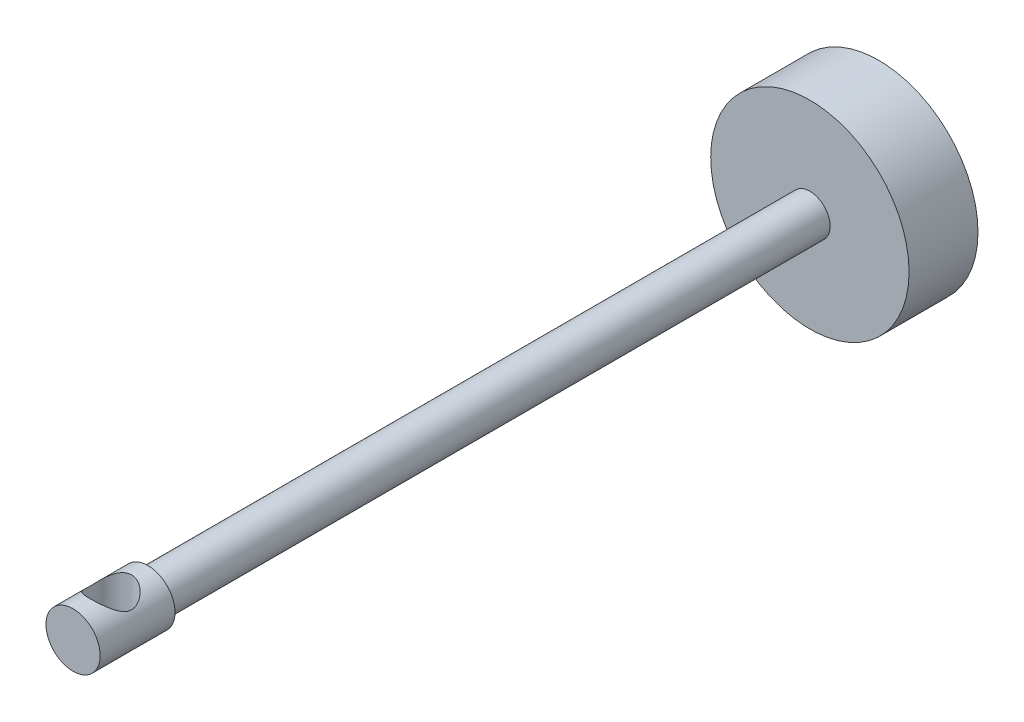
from build123d import *

# Parameters (mm, degrees)
SKETCH1_R               = 11.51636
EXTRUDE1_DEPTH          = 8.001
SKETCH2_R               = 2.3495
EXTRUDE2_DEPTH          = 93.5482
SKETCH3_R               = 3.1496
EXTRUDE3_DEPTH          = 8.6868
CUT_EXTRUDE1_DEPTH      = 95.955351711
CUT_EXTRUDE1_DEPTH_BACK = 95.955351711
SKETCH4_R               = 2.4003


with BuildPart() as part:
    # Sketch1 → Extrude1 (new body)
    with BuildSketch(Plane.XY):
        with Locations(Location((0, 0, 0), (0, 0, 180))):
            Circle(SKETCH1_R)
    extrude(amount=EXTRUDE1_DEPTH)

    # Sketch2 → Extrude2 (add)
    with BuildSketch(Plane.XY):
        with Locations(Location((0, 0, 0), (0, 0, 180))):
            Circle(SKETCH2_R)
    extrude(amount=EXTRUDE2_DEPTH)

    # Sketch3 → Extrude3 (add)
    with BuildSketch(Plane.XY.offset(93.5482)):
        Circle(SKETCH3_R)
    extrude(amount=-EXTRUDE3_DEPTH)

    # Sketch4 → Cut-Extrude1 (cut, two sides: drawn at the far end of the back side and taken through both)
    with BuildSketch(Plane(origin=(0, 0, 0), x_dir=(1, 0, 0), z_dir=(0, 1, 0)).offset(-CUT_EXTRUDE1_DEPTH_BACK)):
        with Locations(Location((0, -89.154, 0), (0, 0, 270))):
            Circle(SKETCH4_R)
    extrude(amount=CUT_EXTRUDE1_DEPTH + CUT_EXTRUDE1_DEPTH_BACK, mode=Mode.SUBTRACT)


solid = part.part
